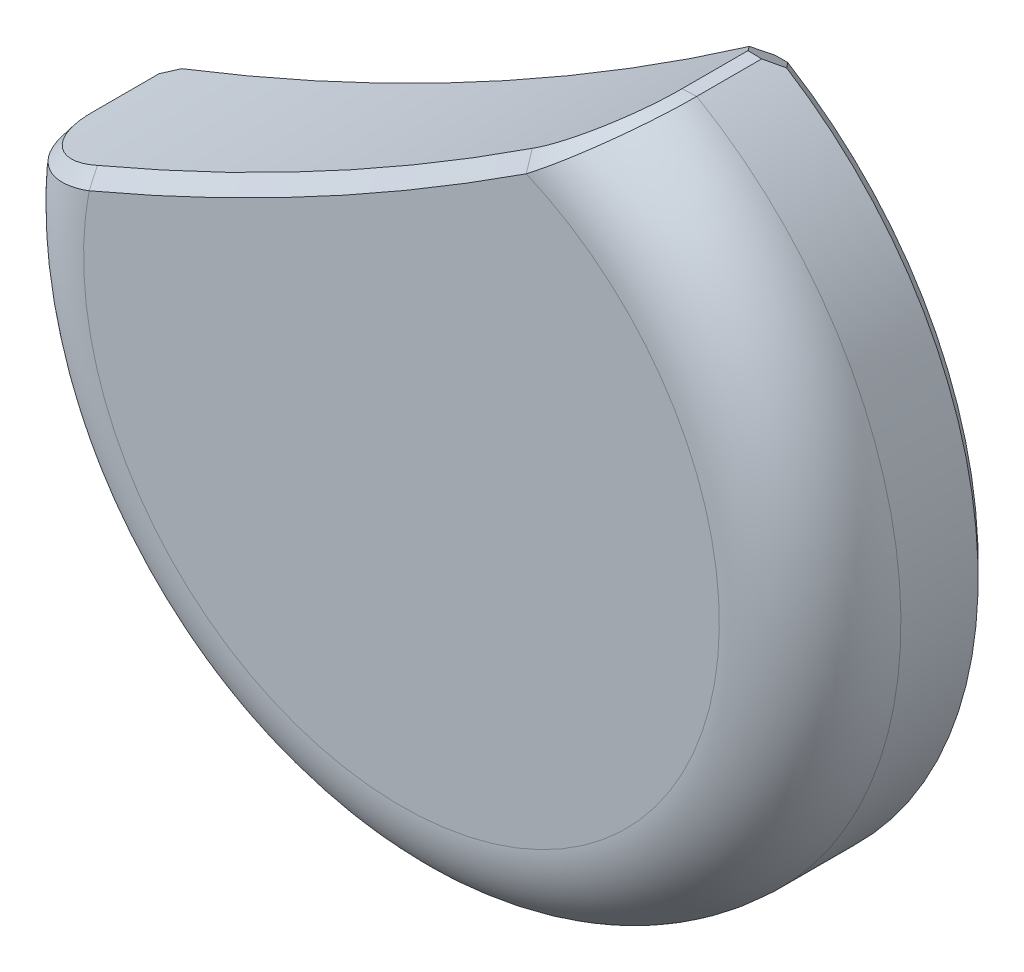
ISO-10303-21;
HEADER;
FILE_DESCRIPTION(('STEP AP214'),'2;1');
FILE_NAME('part.step','',(''),(''),'','','');
FILE_SCHEMA(('AUTOMOTIVE_DESIGN { 1 0 10303 214 1 1 1 1 }'));
ENDSEC;
DATA;
#1=APPLICATION_CONTEXT('core data for automotive mechanical design processes');
#2=APPLICATION_PROTOCOL_DEFINITION('international standard','automotive_design',2000,#1);
#3=PRODUCT_CONTEXT('',#1,'mechanical');
#4=PRODUCT('Part','Part','',(#3));
#5=PRODUCT_RELATED_PRODUCT_CATEGORY('part','',(#4));
#6=PRODUCT_DEFINITION_FORMATION('','',#4);
#7=PRODUCT_DEFINITION_CONTEXT('part definition',#1,'design');
#8=PRODUCT_DEFINITION('design','',#6,#7);
#9=PRODUCT_DEFINITION_SHAPE('','',#8);
#10=(LENGTH_UNIT() NAMED_UNIT(*) SI_UNIT(.MILLI.,.METRE.));
#11=(NAMED_UNIT(*) PLANE_ANGLE_UNIT() SI_UNIT($,.RADIAN.));
#12=(NAMED_UNIT(*) SI_UNIT($,.STERADIAN.) SOLID_ANGLE_UNIT());
#13=UNCERTAINTY_MEASURE_WITH_UNIT(LENGTH_MEASURE(1.E-05),#10,'distance_accuracy_value','');
#14=(GEOMETRIC_REPRESENTATION_CONTEXT(3) GLOBAL_UNCERTAINTY_ASSIGNED_CONTEXT((#13)) GLOBAL_UNIT_ASSIGNED_CONTEXT((#10,
#11,#12)) REPRESENTATION_CONTEXT('',''));
#15=CARTESIAN_POINT('',(0.,0.,0.));
#16=DIRECTION('',(0.,0.,1.));
#17=DIRECTION('',(1.,0.,0.));
#18=AXIS2_PLACEMENT_3D('',#15,#16,#17);
#19=CARTESIAN_POINT('',(0.,0.,2.));
#20=DIRECTION('',(0.,0.,-1.));
#21=DIRECTION('',(-1.,0.,0.));
#22=AXIS2_PLACEMENT_3D('',#19,#20,#21);
#23=CYLINDRICAL_SURFACE('',#22,4.5);
#24=DIRECTION('',(0.,0.,-1.));
#25=VECTOR('',#24,1.);
#26=CARTESIAN_POINT('',(-4.4902318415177,0.296341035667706,2.));
#27=LINE('',#26,#25);
#28=CARTESIAN_POINT('',(-4.49006712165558,0.298816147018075,1.));
#29=VERTEX_POINT('',#28);
#30=CARTESIAN_POINT('',(-4.4902318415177,0.296341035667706,0.285504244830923));
#31=VERTEX_POINT('',#30);
#32=EDGE_CURVE('E125',#29,#31,#27,.T.);
#33=ORIENTED_EDGE('',*,*,#32,.T.);
#34=CARTESIAN_POINT('',(-4.4979723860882,0.135071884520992,0.150000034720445));
#35=CARTESIAN_POINT('',(-4.4976582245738,0.141776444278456,0.155646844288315));
#36=CARTESIAN_POINT('',(-4.49734305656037,0.148481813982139,0.161292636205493));
#37=CARTESIAN_POINT('',(-4.49671057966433,0.161896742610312,0.172584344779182));
#38=CARTESIAN_POINT('',(-4.4963932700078,0.16860630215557,0.178230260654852));
#39=CARTESIAN_POINT('',(-4.49575650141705,0.182029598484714,0.189522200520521));
#40=CARTESIAN_POINT('',(-4.49543704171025,0.18874333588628,0.195168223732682));
#41=CARTESIAN_POINT('',(-4.49479605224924,0.202174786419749,0.206460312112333));
#42=CARTESIAN_POINT('',(-4.49447452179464,0.208892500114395,0.212106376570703));
#43=CARTESIAN_POINT('',(-4.49382940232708,0.222331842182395,0.223398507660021));
#44=CARTESIAN_POINT('',(-4.49350581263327,0.229053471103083,0.229044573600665));
#45=CARTESIAN_POINT('',(-4.49285657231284,0.242500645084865,0.240336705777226));
#46=CARTESIAN_POINT('',(-4.49253092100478,0.249226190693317,0.245982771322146));
#47=CARTESIAN_POINT('',(-4.49187755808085,0.262681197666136,0.257274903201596));
#48=CARTESIAN_POINT('',(-4.491549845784,0.26941065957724,0.262920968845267));
#49=CARTESIAN_POINT('',(-4.49089236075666,0.282873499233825,0.274213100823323));
#50=CARTESIAN_POINT('',(-4.49056258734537,0.289606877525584,0.279859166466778));
#51=CARTESIAN_POINT('',(-4.4902318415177,0.296341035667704,0.285504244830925));
#52=B_SPLINE_CURVE_WITH_KNOTS('',3,(#34,#35,#36,#37,#38,#39,#40,#41,#42,#43,#44,#45,#46,#47,#48,
#49,#50,#51),.UNSPECIFIED.,.F.,.F.,(4,2,2,2,2,2,2,2,4),(0.,0.0263139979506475,
0.0526380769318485,0.0789721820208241,0.105315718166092,0.131668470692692,0.158030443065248,
0.184401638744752,0.210782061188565),.UNSPECIFIED.);
#53=CARTESIAN_POINT('',(-4.4979723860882,0.135071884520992,0.149999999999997));
#54=VERTEX_POINT('',#53);
#55=EDGE_CURVE('E118',#31,#54,#52,.F.);
#56=ORIENTED_EDGE('',*,*,#55,.T.);
#57=CARTESIAN_POINT('',(0.,0.,0.149999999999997));
#58=DIRECTION('',(0.,0.,1.));
#59=DIRECTION('',(1.,0.,0.));
#60=AXIS2_PLACEMENT_3D('',#57,#58,#59);
#61=CIRCLE('',#60,4.5);
#62=CARTESIAN_POINT('',(2.39106829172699,3.81218997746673,0.149999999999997));
#63=VERTEX_POINT('',#62);
#64=EDGE_CURVE('E121',#54,#63,#61,.T.);
#65=ORIENTED_EDGE('',*,*,#64,.T.);
#66=CARTESIAN_POINT('',(2.25164148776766,3.89616614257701,0.285504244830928));
#67=CARTESIAN_POINT('',(2.25742146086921,3.89269480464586,0.27985916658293));
#68=CARTESIAN_POINT('',(2.26320024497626,3.88922309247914,0.274213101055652));
#69=CARTESIAN_POINT('',(2.2747534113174,3.88228013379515,0.262920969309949));
#70=CARTESIAN_POINT('',(2.28052779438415,3.87880888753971,0.257274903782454));
#71=CARTESIAN_POINT('',(2.2920721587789,3.87186686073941,0.245982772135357));
#72=CARTESIAN_POINT('',(2.29784214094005,3.86839608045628,0.240336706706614));
#73=CARTESIAN_POINT('',(2.30937770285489,3.86145498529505,0.229044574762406));
#74=CARTESIAN_POINT('',(2.31514328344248,3.85798467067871,0.223398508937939));
#75=CARTESIAN_POINT('',(2.32667004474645,3.85104450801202,0.212106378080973));
#76=CARTESIAN_POINT('',(2.33243122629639,3.84757466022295,0.20646031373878));
#77=CARTESIAN_POINT('',(2.34394913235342,3.84063545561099,0.195168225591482));
#78=CARTESIAN_POINT('',(2.34970585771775,3.83716609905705,0.189522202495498));
#79=CARTESIAN_POINT('',(2.36121463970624,3.83022792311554,0.178230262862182));
#80=CARTESIAN_POINT('',(2.36696669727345,3.82675910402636,0.172584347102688));
#81=CARTESIAN_POINT('',(2.37846613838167,3.81982201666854,0.161292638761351));
#82=CARTESIAN_POINT('',(2.38421352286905,3.81635374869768,0.15564684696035));
#83=CARTESIAN_POINT('',(2.38995967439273,3.81288509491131,0.150000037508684));
#84=B_SPLINE_CURVE_WITH_KNOTS('',3,(#66,#67,#68,#69,#70,#71,#72,#73,#74,#75,#76,#77,#78,#79,#80,
#81,#82,#83),.UNSPECIFIED.,.F.,.F.,(4,2,2,2,2,2,2,2,4),(0.,0.0263804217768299,
0.0527516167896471,0.0791135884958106,0.105466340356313,0.131809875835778,0.158143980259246,
0.184468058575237,0.210782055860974),.UNSPECIFIED.);
#85=CARTESIAN_POINT('',(2.25164148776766,3.89616614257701,0.285504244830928));
#86=VERTEX_POINT('',#85);
#87=EDGE_CURVE('E438',#63,#86,#84,.F.);
#88=ORIENTED_EDGE('',*,*,#87,.T.);
#89=DIRECTION('',(0.,0.,-1.));
#90=VECTOR('',#89,1.);
#91=CARTESIAN_POINT('',(2.25164148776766,3.89616614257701,2.));
#92=LINE('',#91,#90);
#93=CARTESIAN_POINT('',(2.25164148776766,3.89616614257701,1.));
#94=VERTEX_POINT('',#93);
#95=EDGE_CURVE('E434',#86,#94,#92,.F.);
#96=ORIENTED_EDGE('',*,*,#95,.T.);
#97=CARTESIAN_POINT('',(0.,0.,1.));
#98=DIRECTION('',(0.,0.,1.));
#99=DIRECTION('',(1.,0.,0.));
#100=AXIS2_PLACEMENT_3D('',#97,#98,#99);
#101=CIRCLE('',#100,4.5);
#102=EDGE_CURVE('E143',#94,#29,#101,.F.);
#103=ORIENTED_EDGE('',*,*,#102,.T.);
#104=EDGE_LOOP('',(#33,#56,#65,#88,#96,#103));
#105=FACE_BOUND('',#104,.T.);
#106=ADVANCED_FACE('F35',(#105),#23,.T.);
#107=CARTESIAN_POINT('',(0.,0.,2.));
#108=DIRECTION('',(0.,0.,1.));
#109=DIRECTION('',(1.,0.,0.));
#110=AXIS2_PLACEMENT_3D('',#107,#108,#109);
#111=PLANE('',#110);
#112=CARTESIAN_POINT('',(0.,0.,2.));
#113=DIRECTION('',(0.,0.,1.));
#114=DIRECTION('',(1.,0.,0.));
#115=AXIS2_PLACEMENT_3D('',#112,#113,#114);
#116=CIRCLE('',#115,3.5);
#117=CARTESIAN_POINT('',(-3.43902761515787,0.650452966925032,2.));
#118=VERTEX_POINT('',#117);
#119=CARTESIAN_POINT('',(1.37427007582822,3.21890951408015,2.));
#120=VERTEX_POINT('',#119);
#121=EDGE_CURVE('E431',#118,#120,#116,.T.);
#122=ORIENTED_EDGE('',*,*,#121,.T.);
#123=CARTESIAN_POINT('',(-15.1760028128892,28.4221276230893,2.));
#124=DIRECTION('',(0.,0.,1.));
#125=DIRECTION('',(1.,0.,0.));
#126=AXIS2_PLACEMENT_3D('',#123,#124,#125);
#127=CIRCLE('',#126,30.15);
#128=EDGE_CURVE('E12',#120,#118,#127,.F.);
#129=ORIENTED_EDGE('',*,*,#128,.T.);
#130=EDGE_LOOP('',(#122,#129));
#131=FACE_BOUND('',#130,.T.);
#132=ADVANCED_FACE('F456',(#131),#111,.T.);
#133=CARTESIAN_POINT('',(0.,0.,0.));
#134=DIRECTION('',(0.,0.,1.));
#135=DIRECTION('',(1.,0.,0.));
#136=AXIS2_PLACEMENT_3D('',#133,#134,#135);
#137=PLANE('',#136);
#138=CARTESIAN_POINT('',(0.,0.,0.));
#139=DIRECTION('',(0.,0.,1.));
#140=DIRECTION('',(1.,0.,0.));
#141=AXIS2_PLACEMENT_3D('',#138,#139,#140);
#142=CIRCLE('',#141,4.35);
#143=CARTESIAN_POINT('',(2.2541529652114,3.72038901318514,0.));
#144=VERTEX_POINT('',#143);
#145=CARTESIAN_POINT('',(-4.34559602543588,0.195691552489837,0.));
#146=VERTEX_POINT('',#145);
#147=EDGE_CURVE('E142',#144,#146,#142,.F.);
#148=ORIENTED_EDGE('',*,*,#147,.T.);
#149=CARTESIAN_POINT('',(-4.26537970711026,0.315530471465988,0.));
#150=CARTESIAN_POINT('',(-4.26871356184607,0.310582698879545,-2.61250268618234E-06));
#151=CARTESIAN_POINT('',(-4.27204725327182,0.305634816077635,-4.88853779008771E-06));
#152=CARTESIAN_POINT('',(-4.27871670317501,0.295735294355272,-8.7771095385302E-06));
#153=CARTESIAN_POINT('',(-4.2820524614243,0.290783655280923,-1.03891701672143E-05));
#154=CARTESIAN_POINT('',(-4.28872603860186,0.280876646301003,-1.2956425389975E-05));
#155=CARTESIAN_POINT('',(-4.29206385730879,0.275921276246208,-1.39111520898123E-05));
#156=CARTESIAN_POINT('',(-4.2987415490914,0.266006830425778,-1.51703599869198E-05));
#157=CARTESIAN_POINT('',(-4.30208142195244,0.261047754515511,-1.54743813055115E-05));
#158=CARTESIAN_POINT('',(-4.30876321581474,0.251125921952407,-1.54388024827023E-05));
#159=CARTESIAN_POINT('',(-4.31210513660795,0.246163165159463,-1.50987503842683E-05));
#160=CARTESIAN_POINT('',(-4.3187910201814,0.236233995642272,-1.3781647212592E-05));
#161=CARTESIAN_POINT('',(-4.32213498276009,0.231267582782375,-1.28041520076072E-05));
#162=CARTESIAN_POINT('',(-4.32882494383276,0.221331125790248,-1.02187884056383E-05));
#163=CARTESIAN_POINT('',(-4.33217094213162,0.216361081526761,-8.61048361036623E-06));
#164=CARTESIAN_POINT('',(-4.33886496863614,0.206417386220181,-4.77011553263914E-06));
#165=CARTESIAN_POINT('',(-4.34221299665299,0.201443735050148,-2.53762348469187E-06));
#166=CARTESIAN_POINT('',(-4.34556089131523,0.196469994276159,2.55061209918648E-09));
#167=B_SPLINE_CURVE_WITH_KNOTS('',3,(#149,#150,#151,#152,#153,#154,#155,#156,#157,#158,#159,
#160,#161,#162,#163,#164,#165,#166),.UNSPECIFIED.,.F.,.F.,(4,2,2,2,2,2,2,2,4),(0.,
0.0178984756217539,0.0358097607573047,0.0537337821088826,0.071670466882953,0.0896197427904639,
0.107581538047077,0.125555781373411,0.143542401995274),.UNSPECIFIED.);
#168=CARTESIAN_POINT('',(-4.26537970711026,0.315530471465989,0.));
#169=VERTEX_POINT('',#168);
#170=EDGE_CURVE('E148',#146,#169,#167,.F.);
#171=ORIENTED_EDGE('',*,*,#170,.T.);
#172=CARTESIAN_POINT('',(-15.1760028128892,28.4221276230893,0.));
#173=DIRECTION('',(0.,0.,1.));
#174=DIRECTION('',(1.,0.,0.));
#175=AXIS2_PLACEMENT_3D('',#172,#173,#174);
#176=CIRCLE('',#175,30.15);
#177=CARTESIAN_POINT('',(2.11061110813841,3.71999250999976,0.));
#178=VERTEX_POINT('',#177);
#179=EDGE_CURVE('E531',#169,#178,#176,.T.);
#180=ORIENTED_EDGE('',*,*,#179,.T.);
#181=CARTESIAN_POINT('',(2.25415295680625,3.72038900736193,2.55045415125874E-09));
#182=CARTESIAN_POINT('',(2.24815743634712,3.72037382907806,-2.53762363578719E-06));
#183=CARTESIAN_POINT('',(2.24216191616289,3.72035849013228,-4.77011567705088E-06));
#184=CARTESIAN_POINT('',(2.23017500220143,3.72032749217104,-8.61048374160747E-06));
#185=CARTESIAN_POINT('',(2.22418360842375,3.7203118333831,-1.02187885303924E-05));
#186=CARTESIAN_POINT('',(2.21220497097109,3.72028018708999,-1.28041521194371E-05));
#187=CARTESIAN_POINT('',(2.2062177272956,3.72026419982,-1.3781647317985E-05));
#188=CARTESIAN_POINT('',(2.19424741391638,3.72023188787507,-1.50987504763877E-05));
#189=CARTESIAN_POINT('',(2.18826434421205,3.72021556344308,-1.54388025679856E-05));
#190=CARTESIAN_POINT('',(2.17630240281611,3.72018256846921,-1.54743813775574E-05));
#191=CARTESIAN_POINT('',(2.1703235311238,3.72016589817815,-1.51703600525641E-05));
#192=CARTESIAN_POINT('',(2.15837000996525,3.72013220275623,-1.391115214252E-05));
#193=CARTESIAN_POINT('',(2.15239536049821,3.72011517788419,-1.29564254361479E-05));
#194=CARTESIAN_POINT('',(2.14045030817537,3.72008076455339,-1.0389170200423E-05));
#195=CARTESIAN_POINT('',(2.13447990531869,3.72006337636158,-8.77710956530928E-06));
#196=CARTESIAN_POINT('',(2.12254337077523,3.72002822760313,-4.88853780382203E-06));
#197=CARTESIAN_POINT('',(2.11657723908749,3.7200104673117,-2.61250269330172E-06));
#198=CARTESIAN_POINT('',(2.11061110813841,3.71999250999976,0.));
#199=B_SPLINE_CURVE_WITH_KNOTS('',3,(#181,#182,#183,#184,#185,#186,#187,#188,#189,#190,#191,
#192,#193,#194,#195,#196,#197,#198),.UNSPECIFIED.,.F.,.F.,(4,2,2,2,2,2,2,2,4),(0.,
0.0179866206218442,0.0359608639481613,0.0539226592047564,0.0718719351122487,0.0898086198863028,
0.107732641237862,0.125643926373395,0.14354240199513),.UNSPECIFIED.);
#200=EDGE_CURVE('E150',#178,#144,#199,.F.);
#201=ORIENTED_EDGE('',*,*,#200,.T.);
#202=EDGE_LOOP('',(#148,#171,#180,#201));
#203=FACE_BOUND('',#202,.T.);
#204=ADVANCED_FACE('F457',(#203),#137,.F.);
#205=CARTESIAN_POINT('',(0.,0.,1.));
#206=DIRECTION('',(0.,0.,1.));
#207=DIRECTION('',(1.,0.,0.));
#208=AXIS2_PLACEMENT_3D('',#205,#206,#207);
#209=TOROIDAL_SURFACE('',#208,3.5,1.);
#210=ORIENTED_EDGE('',*,*,#121,.F.);
#211=CARTESIAN_POINT('',(-4.49023184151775,0.296341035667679,1.00000000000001));
#212=CARTESIAN_POINT('',(-4.49848902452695,0.293226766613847,1.59629651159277));
#213=CARTESIAN_POINT('',(-3.9423500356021,0.478877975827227,2.02466124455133));
#214=CARTESIAN_POINT('',(-3.43902761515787,0.650452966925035,2.));
#215=B_SPLINE_CURVE_WITH_KNOTS('',3,(#211,#212,#213,#214),.UNSPECIFIED.,.F.,.F.,(4,4),(0.,
0.00142219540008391),.UNSPECIFIED.);
#216=EDGE_CURVE('E48',#118,#29,#215,.F.);
#217=ORIENTED_EDGE('',*,*,#216,.T.);
#218=ORIENTED_EDGE('',*,*,#102,.F.);
#219=CARTESIAN_POINT('',(1.37259967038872,3.21962267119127,2.));
#220=CARTESIAN_POINT('',(1.79766225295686,3.54433846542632,2.0250242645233));
#221=CARTESIAN_POINT('',(2.25919562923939,3.90159216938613,1.59267961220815));
#222=CARTESIAN_POINT('',(2.25164148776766,3.89616614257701,1.));
#223=B_SPLINE_CURVE_WITH_KNOTS('',3,(#219,#220,#221,#222),.UNSPECIFIED.,.F.,.F.,(4,4),(0.,
0.00142989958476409),.UNSPECIFIED.);
#224=EDGE_CURVE('E56',#94,#120,#223,.F.);
#225=ORIENTED_EDGE('',*,*,#224,.T.);
#226=EDGE_LOOP('',(#210,#217,#218,#225));
#227=FACE_BOUND('',#226,.T.);
#228=ADVANCED_FACE('F430',(#227),#209,.T.);
#229=CARTESIAN_POINT('',(0.,0.,0.149999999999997));
#230=DIRECTION('',(0.,0.,1.));
#231=DIRECTION('',(1.,0.,0.));
#232=AXIS2_PLACEMENT_3D('',#229,#230,#231);
#233=CONICAL_SURFACE('',#232,4.5,0.785398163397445);
#234=ORIENTED_EDGE('',*,*,#64,.F.);
#235=CARTESIAN_POINT('',(-4.28049202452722,0.223031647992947,-0.0637014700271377));
#236=CARTESIAN_POINT('',(-4.35657243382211,0.191851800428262,0.0106538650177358));
#237=CARTESIAN_POINT('',(-4.43251169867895,0.161163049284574,0.0853226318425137));
#238=CARTESIAN_POINT('',(-4.50830966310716,0.130948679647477,0.160211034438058));
#239=CARTESIAN_POINT('',(-4.51498855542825,0.128286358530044,0.166809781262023));
#240=CARTESIAN_POINT('',(-4.52166744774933,0.125624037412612,0.173408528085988));
#241=CARTESIAN_POINT('',(-4.52834634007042,0.122961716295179,0.180007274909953));
#242=B_SPLINE_CURVE_WITH_KNOTS('',3,(#235,#236,#237,#238,#239,#240,#241),.UNSPECIFIED.,.F.,.F.,
(4,3,4),(0.00469936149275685,0.0050302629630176,0.00505942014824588),.UNSPECIFIED.);
#243=EDGE_CURVE('E136',#54,#146,#242,.F.);
#244=ORIENTED_EDGE('',*,*,#243,.T.);
#245=ORIENTED_EDGE('',*,*,#147,.F.);
#246=CARTESIAN_POINT('',(2.38995967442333,3.81288509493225,0.150000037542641));
#247=CARTESIAN_POINT('',(2.38432743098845,3.80902253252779,0.143735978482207));
#248=CARTESIAN_POINT('',(2.37869219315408,3.80516121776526,0.137473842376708));
#249=CARTESIAN_POINT('',(2.36741507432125,3.79744065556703,0.124952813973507));
#250=CARTESIAN_POINT('',(2.36177319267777,3.79358140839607,0.118693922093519));
#251=CARTESIAN_POINT('',(2.35048277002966,3.78586499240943,0.106179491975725));
#252=CARTESIAN_POINT('',(2.34483422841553,3.78200782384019,0.0999239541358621));
#253=CARTESIAN_POINT('',(2.33353046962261,3.77429557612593,0.0874163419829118));
#254=CARTESIAN_POINT('',(2.32787525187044,3.77044049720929,0.0811642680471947));
#255=CARTESIAN_POINT('',(2.31655812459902,3.76273243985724,0.0686636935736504));
#256=CARTESIAN_POINT('',(2.31089621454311,3.75887946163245,0.0624151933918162));
#257=CARTESIAN_POINT('',(2.29956568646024,3.75117561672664,0.0499218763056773));
#258=CARTESIAN_POINT('',(2.29389706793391,3.74732475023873,0.043677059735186));
#259=CARTESIAN_POINT('',(2.28255310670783,3.73962513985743,0.0311912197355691));
#260=CARTESIAN_POINT('',(2.27687776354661,3.73577639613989,0.024950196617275));
#261=CARTESIAN_POINT('',(2.26552033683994,3.72808104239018,0.0124720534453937));
#262=CARTESIAN_POINT('',(2.25983825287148,3.72423443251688,0.00623493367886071));
#263=CARTESIAN_POINT('',(2.25415296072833,3.72038901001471,6.85162929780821E-09));
#264=B_SPLINE_CURVE_WITH_KNOTS('',3,(#246,#247,#248,#249,#250,#251,#252,#253,#254,#255,#256,
#257,#258,#259,#260,#261,#262,#263),.UNSPECIFIED.,.F.,.F.,(4,2,2,2,2,2,2,2,4),(0.,
0.0278014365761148,0.0556058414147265,0.0834130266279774,0.111222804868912,0.139034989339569,
0.166849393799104,0.194665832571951,0.222484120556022),.UNSPECIFIED.);
#265=EDGE_CURVE('E140',#144,#63,#264,.F.);
#266=ORIENTED_EDGE('',*,*,#265,.T.);
#267=EDGE_LOOP('',(#234,#244,#245,#266));
#268=FACE_BOUND('',#267,.T.);
#269=ADVANCED_FACE('F134',(#268),#233,.T.);
#270=CARTESIAN_POINT('',(-15.1760028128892,28.4221276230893,2.));
#271=DIRECTION('',(0.,0.,-1.));
#272=DIRECTION('',(-1.,0.,0.));
#273=AXIS2_PLACEMENT_3D('',#270,#271,#272);
#274=CYLINDRICAL_SURFACE('',#273,30.);
#275=CARTESIAN_POINT('',(-15.1760028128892,28.4221276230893,0.149999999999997));
#276=DIRECTION('',(0.,0.,1.));
#277=DIRECTION('',(1.,0.,0.));
#278=AXIS2_PLACEMENT_3D('',#275,#276,#277);
#279=CIRCLE('',#278,30.);
#280=CARTESIAN_POINT('',(1.98026240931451,3.81191503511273,0.15000002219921));
#281=VERTEX_POINT('',#280);
#282=CARTESIAN_POINT('',(-4.26925348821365,0.474984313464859,0.149999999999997));
#283=VERTEX_POINT('',#282);
#284=EDGE_CURVE('E484',#281,#283,#279,.F.);
#285=ORIENTED_EDGE('',*,*,#284,.T.);
#286=CARTESIAN_POINT('',(-4.39446512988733,0.42644143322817,0.274368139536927));
#287=CARTESIAN_POINT('',(-4.38925262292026,0.428448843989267,0.269176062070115));
#288=CARTESIAN_POINT('',(-4.38403959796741,0.43045812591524,0.263985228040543));
#289=CARTESIAN_POINT('',(-4.3736123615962,0.434480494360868,0.253605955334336));
#290=CARTESIAN_POINT('',(-4.36839815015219,0.43649358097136,0.248417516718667));
#291=CARTESIAN_POINT('',(-4.3579685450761,0.440523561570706,0.238043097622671));
#292=CARTESIAN_POINT('',(-4.35275315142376,0.442540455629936,0.232857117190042));
#293=CARTESIAN_POINT('',(-4.34232118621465,0.446578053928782,0.222487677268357));
#294=CARTESIAN_POINT('',(-4.33710461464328,0.448598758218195,0.217304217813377));
#295=CARTESIAN_POINT('',(-4.32667029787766,0.452643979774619,0.206939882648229));
#296=CARTESIAN_POINT('',(-4.32145255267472,0.454668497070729,0.201759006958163));
#297=CARTESIAN_POINT('',(-4.31101589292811,0.45872134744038,0.191399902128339));
#298=CARTESIAN_POINT('',(-4.30579697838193,0.460749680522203,0.186221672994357));
#299=CARTESIAN_POINT('',(-4.29535798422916,0.464810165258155,0.175867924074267));
#300=CARTESIAN_POINT('',(-4.29013790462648,0.466842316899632,0.170692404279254));
#301=CARTESIAN_POINT('',(-4.27969658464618,0.470910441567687,0.160344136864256));
#302=CARTESIAN_POINT('',(-4.27447534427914,0.472946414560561,0.155171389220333));
#303=CARTESIAN_POINT('',(-4.2692534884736,0.474984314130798,0.150000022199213));
#304=B_SPLINE_CURVE_WITH_KNOTS('',3,(#286,#287,#288,#289,#290,#291,#292,#293,#294,#295,#296,
#297,#298,#299,#300,#301,#302,#303),.UNSPECIFIED.,.F.,.F.,(4,2,2,2,2,2,2,2,4),(0.,
0.0228783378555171,0.0457572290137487,0.0686365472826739,0.0915161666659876,0.114395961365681,
0.13727580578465,0.160155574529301,0.183035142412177),.UNSPECIFIED.);
#305=CARTESIAN_POINT('',(-4.39446513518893,0.426441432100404,0.274368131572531));
#306=VERTEX_POINT('',#305);
#307=EDGE_CURVE('E218',#283,#306,#304,.F.);
#308=ORIENTED_EDGE('',*,*,#307,.T.);
#309=DIRECTION('',(0.,0.,-1.));
#310=VECTOR('',#309,1.);
#311=CARTESIAN_POINT('',(-4.39446513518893,0.426441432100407,2.));
#312=LINE('',#311,#310);
#313=CARTESIAN_POINT('',(-4.39446513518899,0.426441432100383,1.00000000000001));
#314=VERTEX_POINT('',#313);
#315=EDGE_CURVE('E488',#306,#314,#312,.F.);
#316=ORIENTED_EDGE('',*,*,#315,.T.);
#317=CARTESIAN_POINT('',(-3.49742052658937,0.788620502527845,1.85));
#318=CARTESIAN_POINT('',(-3.93032841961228,0.604579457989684,1.87096205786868));
#319=CARTESIAN_POINT('',(-4.40127339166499,0.423525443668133,1.50685203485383));
#320=CARTESIAN_POINT('',(-4.39446513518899,0.426441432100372,1.00000000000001));
#321=B_SPLINE_CURVE_WITH_KNOTS('',3,(#317,#318,#319,#320),.UNSPECIFIED.,.F.,.F.,(4,4),(0.,
0.00142219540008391),.UNSPECIFIED.);
#322=CARTESIAN_POINT('',(-3.49742052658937,0.788620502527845,1.85));
#323=VERTEX_POINT('',#322);
#324=EDGE_CURVE('E364',#314,#323,#321,.F.);
#325=ORIENTED_EDGE('',*,*,#324,.T.);
#326=CARTESIAN_POINT('',(-15.1760028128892,28.4221276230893,1.85));
#327=DIRECTION('',(0.,0.,1.));
#328=DIRECTION('',(1.,0.,0.));
#329=AXIS2_PLACEMENT_3D('',#326,#327,#328);
#330=CIRCLE('',#329,30.);
#331=CARTESIAN_POINT('',(1.29026831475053,3.34500826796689,1.85));
#332=VERTEX_POINT('',#331);
#333=EDGE_CURVE('E527',#323,#332,#330,.T.);
#334=ORIENTED_EDGE('',*,*,#333,.T.);
#335=CARTESIAN_POINT('',(2.09025548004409,3.88895977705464,1.));
#336=CARTESIAN_POINT('',(2.0967783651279,3.89324132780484,1.50377767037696));
#337=CARTESIAN_POINT('',(1.68631010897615,3.60389678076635,1.8712706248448));
#338=CARTESIAN_POINT('',(1.29026831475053,3.34500826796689,1.85));
#339=B_SPLINE_CURVE_WITH_KNOTS('',3,(#335,#336,#337,#338),.UNSPECIFIED.,.F.,.F.,(4,4),(0.,
0.00142989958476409),.UNSPECIFIED.);
#340=CARTESIAN_POINT('',(2.09025548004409,3.88895977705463,1.));
#341=VERTEX_POINT('',#340);
#342=EDGE_CURVE('E421',#332,#341,#339,.F.);
#343=ORIENTED_EDGE('',*,*,#342,.T.);
#344=DIRECTION('',(0.,0.,-1.));
#345=VECTOR('',#344,1.);
#346=CARTESIAN_POINT('',(2.09025548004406,3.88895977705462,2.));
#347=LINE('',#346,#345);
#348=CARTESIAN_POINT('',(2.09025548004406,3.88895977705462,0.274368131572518));
#349=VERTEX_POINT('',#348);
#350=EDGE_CURVE('E524',#341,#349,#347,.T.);
#351=ORIENTED_EDGE('',*,*,#350,.T.);
#352=CARTESIAN_POINT('',(1.93912422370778,3.78328782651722,0.103831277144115));
#353=CARTESIAN_POINT('',(2.00551629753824,3.82940642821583,0.178186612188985));
#354=CARTESIAN_POINT('',(2.07151207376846,3.8756475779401,0.252855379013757));
#355=CARTESIAN_POINT('',(2.1371114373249,3.92200364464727,0.327743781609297));
#356=CARTESIAN_POINT('',(2.14289168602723,3.926088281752,0.334342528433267));
#357=CARTESIAN_POINT('',(2.14867193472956,3.93017291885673,0.340941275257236));
#358=CARTESIAN_POINT('',(2.15445218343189,3.93425755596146,0.347540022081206));
#359=B_SPLINE_CURVE_WITH_KNOTS('',3,(#352,#353,#354,#355,#356,#357,#358),.UNSPECIFIED.,.F.,.F.,
(4,3,4),(0.00155811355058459,0.00188928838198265,0.00191846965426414),.UNSPECIFIED.);
#360=EDGE_CURVE('E486',#349,#281,#359,.F.);
#361=ORIENTED_EDGE('',*,*,#360,.T.);
#362=EDGE_LOOP('',(#285,#308,#316,#325,#334,#343,#351,#361));
#363=FACE_BOUND('',#362,.T.);
#364=ADVANCED_FACE('F496',(#363),#274,.F.);
#365=CARTESIAN_POINT('',(2.25164148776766,3.89616614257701,1.));
#366=CARTESIAN_POINT('',(2.25919562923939,3.90159216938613,1.59267961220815));
#367=CARTESIAN_POINT('',(1.79766225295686,3.54433846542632,2.0250242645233));
#368=CARTESIAN_POINT('',(1.37259967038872,3.21962267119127,2.));
#369=CARTESIAN_POINT('',(2.09025548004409,3.88895977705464,1.));
#370=CARTESIAN_POINT('',(2.0967783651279,3.89324132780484,1.50377767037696));
#371=CARTESIAN_POINT('',(1.68631010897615,3.60389678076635,1.8712706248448));
#372=CARTESIAN_POINT('',(1.29026831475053,3.34500826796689,1.85));
#373=B_SPLINE_SURFACE_WITH_KNOTS('',1,3,((#365,#366,#367,#368),(#369,#370,#371,#372)),
.UNSPECIFIED.,.F.,.F.,.F.,(2,2),(4,4),(0.,1.),(0.,0.00142989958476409),.UNSPECIFIED.);
#374=CARTESIAN_POINT('',(2.25164148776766,3.89616614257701,1.));
#375=CARTESIAN_POINT('',(2.09025548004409,3.88895977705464,1.));
#376=B_SPLINE_CURVE_WITH_KNOTS('',1,(#374,#375),.UNSPECIFIED.,.F.,.F.,(2,2),(0.,1.),.UNSPECIFIED.);
#377=EDGE_CURVE('E379',#341,#94,#376,.F.);
#378=CARTESIAN_POINT('',(1.29026831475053,3.34500826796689,1.85));
#379=CARTESIAN_POINT('',(1.37259967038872,3.21962267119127,2.));
#380=B_SPLINE_CURVE_WITH_KNOTS('',1,(#378,#379),.UNSPECIFIED.,.F.,.F.,(2,2),(0.,1.),.UNSPECIFIED.);
#381=EDGE_CURVE('E402',#120,#332,#380,.F.);
#382=ORIENTED_EDGE('',*,*,#377,.F.);
#383=ORIENTED_EDGE('',*,*,#342,.F.);
#384=ORIENTED_EDGE('',*,*,#381,.F.);
#385=ORIENTED_EDGE('',*,*,#224,.F.);
#386=EDGE_LOOP('',(#382,#383,#384,#385));
#387=FACE_BOUND('',#386,.T.);
#388=ADVANCED_FACE('F37',(#387),#373,.T.);
#389=CARTESIAN_POINT('',(-15.1760028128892,28.4221276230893,1.85));
#390=DIRECTION('',(0.,0.,1.));
#391=DIRECTION('',(1.,0.,0.));
#392=AXIS2_PLACEMENT_3D('',#389,#390,#391);
#393=CONICAL_SURFACE('',#392,30.,0.785398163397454);
#394=ORIENTED_EDGE('',*,*,#381,.T.);
#395=ORIENTED_EDGE('',*,*,#333,.F.);
#396=CARTESIAN_POINT('',(-3.43902761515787,0.650452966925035,2.));
#397=CARTESIAN_POINT('',(-3.49742052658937,0.788620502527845,1.85));
#398=B_SPLINE_CURVE_WITH_KNOTS('',1,(#396,#397),.UNSPECIFIED.,.F.,.F.,(2,2),(0.,1.),.UNSPECIFIED.);
#399=EDGE_CURVE('E354',#118,#323,#398,.T.);
#400=ORIENTED_EDGE('',*,*,#399,.F.);
#401=ORIENTED_EDGE('',*,*,#128,.F.);
#402=EDGE_LOOP('',(#394,#395,#400,#401));
#403=FACE_BOUND('',#402,.T.);
#404=ADVANCED_FACE('F327',(#403),#393,.F.);
#405=CARTESIAN_POINT('',(2.09025548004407,3.88895977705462,2.));
#406=DIRECTION('',(-0.0446085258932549,0.999004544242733,0.));
#407=DIRECTION('',(-0.999004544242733,-0.0446085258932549,0.));
#408=AXIS2_PLACEMENT_3D('',#405,#406,#407);
#409=PLANE('',#408);
#410=ORIENTED_EDGE('',*,*,#377,.T.);
#411=ORIENTED_EDGE('',*,*,#95,.F.);
#412=CARTESIAN_POINT('',(2.09025546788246,3.88895977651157,0.274368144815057));
#413=CARTESIAN_POINT('',(2.09696187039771,3.88926148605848,0.274829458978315));
#414=CARTESIAN_POINT('',(2.10366827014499,3.8895629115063,0.27529099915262));
#415=CARTESIAN_POINT('',(2.11708617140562,3.89016543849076,0.276214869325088));
#416=CARTESIAN_POINT('',(2.1237976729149,3.89046653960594,0.276677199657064));
#417=CARTESIAN_POINT('',(2.13722574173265,3.89106843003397,0.277602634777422));
#418=CARTESIAN_POINT('',(2.14394230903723,3.89136921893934,0.27806573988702));
#419=CARTESIAN_POINT('',(2.15738047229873,3.89197050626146,0.278992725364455));
#420=CARTESIAN_POINT('',(2.16410206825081,3.89227100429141,0.279456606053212));
#421=CARTESIAN_POINT('',(2.17755025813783,3.89287169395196,0.280385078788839));
#422=CARTESIAN_POINT('',(2.18427685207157,3.89317188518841,0.280849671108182));
#423=CARTESIAN_POINT('',(2.19773500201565,3.89377208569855,0.281779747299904));
#424=CARTESIAN_POINT('',(2.20446655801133,3.89407209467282,0.28224523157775));
#425=CARTESIAN_POINT('',(2.2179355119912,3.89467153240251,0.283176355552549));
#426=CARTESIAN_POINT('',(2.22467291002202,3.89497096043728,0.283641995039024));
#427=CARTESIAN_POINT('',(2.23815401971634,3.8955691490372,0.284573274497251));
#428=CARTESIAN_POINT('',(2.24489773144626,3.89586790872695,0.285038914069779));
#429=CARTESIAN_POINT('',(2.25164148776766,3.89616614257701,0.285504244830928));
#430=B_SPLINE_CURVE_WITH_KNOTS('',3,(#412,#413,#414,#415,#416,#417,#418,#419,#420,#421,#422,
#423,#424,#425,#426,#427,#428,#429),.UNSPECIFIED.,.F.,.F.,(4,2,2,2,2,2,2,2,4),(0.,
0.0201870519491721,0.0403894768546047,0.0606071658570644,0.080840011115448,0.101087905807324,
0.1213507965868,0.141631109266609,0.161930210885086),.UNSPECIFIED.);
#431=EDGE_CURVE('E437',#349,#86,#430,.T.);
#432=ORIENTED_EDGE('',*,*,#431,.F.);
#433=ORIENTED_EDGE('',*,*,#350,.F.);
#434=EDGE_LOOP('',(#410,#411,#432,#433));
#435=FACE_BOUND('',#434,.T.);
#436=ADVANCED_FACE('F264',(#435),#409,.T.);
#437=CARTESIAN_POINT('',(-3.43902761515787,0.650452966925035,2.));
#438=CARTESIAN_POINT('',(-3.9423500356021,0.478877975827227,2.02466124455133));
#439=CARTESIAN_POINT('',(-4.49848902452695,0.293226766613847,1.59629651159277));
#440=CARTESIAN_POINT('',(-4.49023184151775,0.296341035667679,1.00000000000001));
#441=CARTESIAN_POINT('',(-3.49742052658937,0.788620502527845,1.85));
#442=CARTESIAN_POINT('',(-3.93032841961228,0.604579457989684,1.87096205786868));
#443=CARTESIAN_POINT('',(-4.40127339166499,0.423525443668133,1.50685203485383));
#444=CARTESIAN_POINT('',(-4.39446513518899,0.426441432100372,1.00000000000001));
#445=B_SPLINE_SURFACE_WITH_KNOTS('',1,3,((#437,#438,#439,#440),(#441,#442,#443,#444)),
.UNSPECIFIED.,.F.,.F.,.F.,(2,2),(4,4),(0.,1.),(0.,0.00142219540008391),.UNSPECIFIED.);
#446=CARTESIAN_POINT('',(-4.39446513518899,0.426441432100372,1.00000000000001));
#447=CARTESIAN_POINT('',(-4.49023184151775,0.296341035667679,1.00000000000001));
#448=B_SPLINE_CURVE_WITH_KNOTS('',1,(#446,#447),.UNSPECIFIED.,.F.,.F.,(2,2),(0.,1.),.UNSPECIFIED.);
#449=EDGE_CURVE('E436',#29,#314,#448,.F.);
#450=ORIENTED_EDGE('',*,*,#399,.T.);
#451=ORIENTED_EDGE('',*,*,#324,.F.);
#452=ORIENTED_EDGE('',*,*,#449,.F.);
#453=ORIENTED_EDGE('',*,*,#216,.F.);
#454=EDGE_LOOP('',(#450,#451,#452,#453));
#455=FACE_BOUND('',#454,.T.);
#456=ADVANCED_FACE('F263',(#455),#445,.T.);
#457=CARTESIAN_POINT('',(2.19588310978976,3.68109392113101,-0.0637014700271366));
#458=CARTESIAN_POINT('',(2.26411627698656,3.72697034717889,0.0106538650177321));
#459=CARTESIAN_POINT('',(2.33186283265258,3.77300267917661,0.0853226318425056));
#460=CARTESIAN_POINT('',(2.39913657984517,3.81918148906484,0.160211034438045));
#461=CARTESIAN_POINT('',(2.4050643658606,3.82325050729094,0.166809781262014));
#462=CARTESIAN_POINT('',(2.41099215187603,3.82731952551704,0.173408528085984));
#463=CARTESIAN_POINT('',(2.41691993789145,3.83138854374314,0.180007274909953));
#464=CARTESIAN_POINT('',(1.93912422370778,3.78328782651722,0.103831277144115));
#465=CARTESIAN_POINT('',(2.00551629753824,3.82940642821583,0.178186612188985));
#466=CARTESIAN_POINT('',(2.07151207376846,3.8756475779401,0.252855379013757));
#467=CARTESIAN_POINT('',(2.1371114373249,3.92200364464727,0.327743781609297));
#468=CARTESIAN_POINT('',(2.14289168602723,3.926088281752,0.334342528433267));
#469=CARTESIAN_POINT('',(2.14867193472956,3.93017291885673,0.340941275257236));
#470=CARTESIAN_POINT('',(2.15445218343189,3.93425755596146,0.347540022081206));
#471=CARTESIAN_POINT('',(1.93655663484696,3.78430976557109,0.105506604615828));
#472=CARTESIAN_POINT('',(2.00293029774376,3.8304307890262,0.179861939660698));
#473=CARTESIAN_POINT('',(2.06890856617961,3.87667402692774,0.254530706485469));
#474=CARTESIAN_POINT('',(2.1344911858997,3.92303186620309,0.32941910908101));
#475=CARTESIAN_POINT('',(2.1402699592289,3.92711665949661,0.336017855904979));
#476=CARTESIAN_POINT('',(2.1460487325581,3.93120145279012,0.342616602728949));
#477=CARTESIAN_POINT('',(2.1518275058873,3.93528624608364,0.349215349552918));
#478=B_SPLINE_SURFACE_WITH_KNOTS('',1,3,((#457,#458,#459,#460,#461,#462,#463),(#464,#465,#466,
#467,#468,#469,#470),(#471,#472,#473,#474,#475,#476,#477)),.UNSPECIFIED.,.F.,.F.,.F.,(2,1,2),(4,
3,4),(0.,1.,1.01),(0.00155811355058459,0.00188928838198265,0.00191846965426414),.UNSPECIFIED.);
#479=CARTESIAN_POINT('',(2.11061110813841,3.71999250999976,0.));
#480=CARTESIAN_POINT('',(2.10520757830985,3.72381955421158,0.00625043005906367));
#481=CARTESIAN_POINT('',(2.09980186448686,3.72764606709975,0.0124992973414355));
#482=CARTESIAN_POINT('',(2.08898311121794,3.73530013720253,0.0249973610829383));
#483=CARTESIAN_POINT('',(2.08357006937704,3.73912769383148,0.0312465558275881));
#484=CARTESIAN_POINT('',(2.07273668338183,3.74678384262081,0.0437452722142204));
#485=CARTESIAN_POINT('',(2.06731633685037,3.75061243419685,0.0499947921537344));
#486=CARTESIAN_POINT('',(2.05646836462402,3.75827064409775,0.0624941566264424));
#487=CARTESIAN_POINT('',(2.05104073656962,3.76210026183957,0.0687439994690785));
#488=CARTESIAN_POINT('',(2.04017822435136,3.76976051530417,0.081244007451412));
#489=CARTESIAN_POINT('',(2.03474333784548,3.77359115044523,0.0874941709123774));
#490=CARTESIAN_POINT('',(2.02386633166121,3.78125342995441,0.09999481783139));
#491=CARTESIAN_POINT('',(2.01842420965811,3.78508507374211,0.106245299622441));
#492=CARTESIAN_POINT('',(2.00753275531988,3.79274936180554,0.118746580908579));
#493=CARTESIAN_POINT('',(2.00208342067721,3.79658200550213,0.124997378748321));
#494=CARTESIAN_POINT('',(1.99117756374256,3.80424828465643,0.137499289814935));
#495=CARTESIAN_POINT('',(1.98572103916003,3.80808191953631,0.143750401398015));
#496=CARTESIAN_POINT('',(1.98026239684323,3.81191501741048,0.149999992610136));
#497=B_SPLINE_CURVE_WITH_KNOTS('',3,(#479,#480,#481,#482,#483,#484,#485,#486,#487,#488,#489,
#490,#491,#492,#493,#494,#495,#496),.UNSPECIFIED.,.F.,.F.,(4,2,2,2,2,2,2,2,4),(0.,
0.0273168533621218,0.054648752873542,0.0819956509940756,0.109357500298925,0.136734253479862,
0.164125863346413,0.191532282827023,0.218953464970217),.UNSPECIFIED.);
#498=EDGE_CURVE('E234',#281,#178,#497,.F.);
#499=ORIENTED_EDGE('',*,*,#265,.F.);
#500=ORIENTED_EDGE('',*,*,#200,.F.);
#501=ORIENTED_EDGE('',*,*,#498,.F.);
#502=ORIENTED_EDGE('',*,*,#360,.F.);
#503=ORIENTED_EDGE('',*,*,#431,.T.);
#504=ORIENTED_EDGE('',*,*,#87,.F.);
#505=EDGE_LOOP('',(#499,#500,#501,#502,#503,#504));
#506=FACE_BOUND('',#505,.T.);
#507=ADVANCED_FACE('F252',(#506),#478,.T.);
#508=CARTESIAN_POINT('',(-4.39446513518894,0.426441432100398,2.));
#509=DIRECTION('',(-0.805341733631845,0.592810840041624,0.));
#510=DIRECTION('',(-0.592810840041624,-0.805341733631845,0.));
#511=AXIS2_PLACEMENT_3D('',#508,#509,#510);
#512=PLANE('',#511);
#513=ORIENTED_EDGE('',*,*,#449,.T.);
#514=ORIENTED_EDGE('',*,*,#315,.F.);
#515=CARTESIAN_POINT('',(-4.4902318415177,0.296341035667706,0.285504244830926));
#516=CARTESIAN_POINT('',(-4.48623249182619,0.301779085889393,0.285038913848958));
#517=CARTESIAN_POINT('',(-4.48223272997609,0.307216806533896,0.284573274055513));
#518=CARTESIAN_POINT('',(-4.47423616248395,0.31808662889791,0.283641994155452));
#519=CARTESIAN_POINT('',(-4.4702393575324,0.32351873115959,0.283176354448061));
#520=CARTESIAN_POINT('',(-4.46224851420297,0.33437775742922,0.282245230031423));
#521=CARTESIAN_POINT('',(-4.458254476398,0.339804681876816,0.281779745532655));
#522=CARTESIAN_POINT('',(-4.45026900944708,0.350654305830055,0.280849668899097));
#523=CARTESIAN_POINT('',(-4.44627758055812,0.35607700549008,0.280385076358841));
#524=CARTESIAN_POINT('',(-4.43829724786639,0.366918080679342,0.279456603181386));
#525=CARTESIAN_POINT('',(-4.43430834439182,0.372336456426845,0.278992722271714));
#526=CARTESIAN_POINT('',(-4.42633309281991,0.383168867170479,0.278065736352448));
#527=CARTESIAN_POINT('',(-4.42234674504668,0.388582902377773,0.277602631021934));
#528=CARTESIAN_POINT('',(-4.41437660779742,0.39940658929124,0.276677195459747));
#529=CARTESIAN_POINT('',(-4.41039281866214,0.40481624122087,0.276214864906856));
#530=CARTESIAN_POINT('',(-4.4024278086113,0.415631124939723,0.275290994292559));
#531=CARTESIAN_POINT('',(-4.39844658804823,0.421036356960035,0.274829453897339));
#532=CARTESIAN_POINT('',(-4.3944651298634,0.426441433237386,0.274368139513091));
#533=B_SPLINE_CURVE_WITH_KNOTS('',3,(#515,#516,#517,#518,#519,#520,#521,#522,#523,#524,#525,
#526,#527,#528,#529,#530,#531,#532),.UNSPECIFIED.,.F.,.F.,(4,2,2,2,2,2,2,2,4),(0.,
0.0202991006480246,0.0405794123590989,0.0608423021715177,0.0810901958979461,0.101323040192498,
0.121540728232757,0.141743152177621,0.161930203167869),.UNSPECIFIED.);
#534=EDGE_CURVE('E207',#31,#306,#533,.T.);
#535=ORIENTED_EDGE('',*,*,#534,.F.);
#536=ORIENTED_EDGE('',*,*,#32,.F.);
#537=EDGE_LOOP('',(#513,#514,#535,#536));
#538=FACE_BOUND('',#537,.T.);
#539=ADVANCED_FACE('F173',(#538),#512,.T.);
#540=CARTESIAN_POINT('',(-15.1760028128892,28.4221276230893,0.));
#541=DIRECTION('',(0.,0.,-1.));
#542=DIRECTION('',(-1.,0.,0.));
#543=AXIS2_PLACEMENT_3D('',#540,#541,#542);
#544=CONICAL_SURFACE('',#543,30.15,0.78539816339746);
#545=ORIENTED_EDGE('',*,*,#498,.T.);
#546=ORIENTED_EDGE('',*,*,#179,.F.);
#547=CARTESIAN_POINT('',(-4.2692534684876,0.474984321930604,0.150000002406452));
#548=CARTESIAN_POINT('',(-4.26910484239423,0.468315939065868,0.14375041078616));
#549=CARTESIAN_POINT('',(-4.26895459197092,0.461649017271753,0.137499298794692));
#550=CARTESIAN_POINT('',(-4.26865091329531,0.448321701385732,0.124997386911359));
#551=CARTESIAN_POINT('',(-4.26849748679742,0.441661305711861,0.118746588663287));
#552=CARTESIAN_POINT('',(-4.26818745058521,0.42834706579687,0.106245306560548));
#553=CARTESIAN_POINT('',(-4.26803084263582,0.421693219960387,0.0999948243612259));
#554=CARTESIAN_POINT('',(-4.26771443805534,0.408392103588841,0.0874941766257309));
#555=CARTESIAN_POINT('',(-4.2675546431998,0.40174483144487,0.0812440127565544));
#556=CARTESIAN_POINT('',(-4.26723185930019,0.388456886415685,0.0687440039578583));
#557=CARTESIAN_POINT('',(-4.2670688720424,0.381816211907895,0.062494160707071));
#558=CARTESIAN_POINT('',(-4.26673969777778,0.368541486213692,0.049994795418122));
#559=CARTESIAN_POINT('',(-4.26657351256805,0.361907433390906,0.0437452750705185));
#560=CARTESIAN_POINT('',(-4.26623793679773,0.348645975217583,0.0312465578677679));
#561=CARTESIAN_POINT('',(-4.26606854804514,0.342018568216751,0.0249973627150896));
#562=CARTESIAN_POINT('',(-4.26572655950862,0.328770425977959,0.012499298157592));
#563=CARTESIAN_POINT('',(-4.26555396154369,0.322149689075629,0.00625043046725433));
#564=CARTESIAN_POINT('',(-4.26537970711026,0.31553047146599,0.));
#565=B_SPLINE_CURVE_WITH_KNOTS('',3,(#547,#548,#549,#550,#551,#552,#553,#554,#555,#556,#557,
#558,#559,#560,#561,#562,#563,#564),.UNSPECIFIED.,.F.,.F.,(4,2,2,2,2,2,2,2,4),(0.,
0.027421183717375,0.0548276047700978,0.082219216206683,0.109595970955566,0.13695782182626,
0.164304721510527,0.191636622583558,0.218953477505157),.UNSPECIFIED.);
#566=EDGE_CURVE('E676',#283,#169,#565,.T.);
#567=ORIENTED_EDGE('',*,*,#566,.F.);
#568=ORIENTED_EDGE('',*,*,#284,.F.);
#569=EDGE_LOOP('',(#545,#546,#567,#568));
#570=FACE_BOUND('',#569,.T.);
#571=ADVANCED_FACE('F170',(#570),#544,.F.);
#572=CARTESIAN_POINT('',(-4.52895161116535,0.120208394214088,0.17833194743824));
#573=CARTESIAN_POINT('',(-4.52227202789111,0.122872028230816,0.171733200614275));
#574=CARTESIAN_POINT('',(-4.51559244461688,0.125535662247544,0.16513445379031));
#575=CARTESIAN_POINT('',(-4.50891286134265,0.128199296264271,0.158535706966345));
#576=CARTESIAN_POINT('',(-4.43310705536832,0.158428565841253,0.0836473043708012));
#577=CARTESIAN_POINT('',(-4.35715978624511,0.189133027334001,0.00897853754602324));
#578=CARTESIAN_POINT('',(-4.2810711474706,0.220329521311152,-0.0653767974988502));
#579=CARTESIAN_POINT('',(-4.52834634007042,0.122961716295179,0.180007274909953));
#580=CARTESIAN_POINT('',(-4.52166744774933,0.125624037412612,0.173408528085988));
#581=CARTESIAN_POINT('',(-4.51498855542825,0.128286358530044,0.166809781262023));
#582=CARTESIAN_POINT('',(-4.50830966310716,0.130948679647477,0.160211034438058));
#583=CARTESIAN_POINT('',(-4.43251169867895,0.161163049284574,0.0853226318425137));
#584=CARTESIAN_POINT('',(-4.35657243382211,0.191851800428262,0.0106538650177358));
#585=CARTESIAN_POINT('',(-4.28049202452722,0.223031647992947,-0.0637014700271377));
#586=CARTESIAN_POINT('',(-4.46781923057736,0.398293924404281,0.347540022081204));
#587=CARTESIAN_POINT('',(-4.46120943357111,0.400824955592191,0.340941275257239));
#588=CARTESIAN_POINT('',(-4.45459963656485,0.403355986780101,0.334342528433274));
#589=CARTESIAN_POINT('',(-4.44798983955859,0.405887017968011,0.32774378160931));
#590=CARTESIAN_POINT('',(-4.37297602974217,0.434611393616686,0.252855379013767));
#591=CARTESIAN_POINT('',(-4.29783719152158,0.46372910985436,0.178186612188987));
#592=CARTESIAN_POINT('',(-4.22257973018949,0.493244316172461,0.103831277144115));
#593=B_SPLINE_SURFACE_WITH_KNOTS('',1,3,((#572,#573,#574,#575,#576,#577,#578),(#579,#580,#581,
#582,#583,#584,#585),(#586,#587,#588,#589,#590,#591,#592)),.UNSPECIFIED.,.F.,.F.,.F.,(2,1,2),(4,
3,4),(-0.01,0.,1.),(0.00469936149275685,0.00472851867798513,0.00505942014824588),.UNSPECIFIED.);
#594=ORIENTED_EDGE('',*,*,#534,.T.);
#595=ORIENTED_EDGE('',*,*,#307,.F.);
#596=ORIENTED_EDGE('',*,*,#566,.T.);
#597=ORIENTED_EDGE('',*,*,#170,.F.);
#598=ORIENTED_EDGE('',*,*,#243,.F.);
#599=ORIENTED_EDGE('',*,*,#55,.F.);
#600=EDGE_LOOP('',(#594,#595,#596,#597,#598,#599));
#601=FACE_BOUND('',#600,.T.);
#602=ADVANCED_FACE('F146',(#601),#593,.T.);
#603=CLOSED_SHELL('',(#106,#132,#204,#228,#269,#364,#388,#404,#436,#456,#507,#539,#571,#602));
#604=MANIFOLD_SOLID_BREP('B2',#603);
#605=ADVANCED_BREP_SHAPE_REPRESENTATION('',(#18,#604),#14);
#606=SHAPE_DEFINITION_REPRESENTATION(#9,#605);
ENDSEC;
END-ISO-10303-21;
